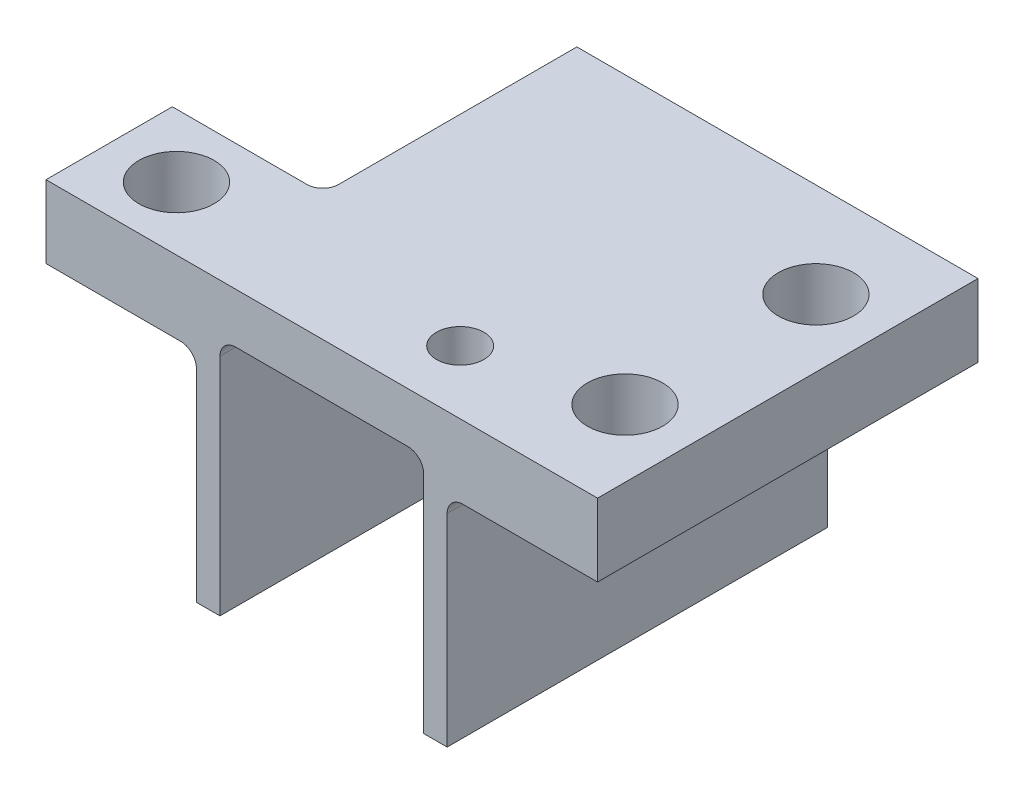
ISO-10303-21;
HEADER;
FILE_DESCRIPTION(('STEP AP214'),'2;1');
FILE_NAME('part.step','',(''),(''),'','','');
FILE_SCHEMA(('AUTOMOTIVE_DESIGN { 1 0 10303 214 1 1 1 1 }'));
ENDSEC;
DATA;
#1=APPLICATION_CONTEXT('core data for automotive mechanical design processes');
#2=APPLICATION_PROTOCOL_DEFINITION('international standard','automotive_design',2000,#1);
#3=PRODUCT_CONTEXT('',#1,'mechanical');
#4=PRODUCT('Part','Part','',(#3));
#5=PRODUCT_RELATED_PRODUCT_CATEGORY('part','',(#4));
#6=PRODUCT_DEFINITION_FORMATION('','',#4);
#7=PRODUCT_DEFINITION_CONTEXT('part definition',#1,'design');
#8=PRODUCT_DEFINITION('design','',#6,#7);
#9=PRODUCT_DEFINITION_SHAPE('','',#8);
#10=(LENGTH_UNIT() NAMED_UNIT(*) SI_UNIT(.MILLI.,.METRE.));
#11=(NAMED_UNIT(*) PLANE_ANGLE_UNIT() SI_UNIT($,.RADIAN.));
#12=(NAMED_UNIT(*) SI_UNIT($,.STERADIAN.) SOLID_ANGLE_UNIT());
#13=UNCERTAINTY_MEASURE_WITH_UNIT(LENGTH_MEASURE(1.E-05),#10,'distance_accuracy_value','');
#14=(GEOMETRIC_REPRESENTATION_CONTEXT(3) GLOBAL_UNCERTAINTY_ASSIGNED_CONTEXT((#13)) GLOBAL_UNIT_ASSIGNED_CONTEXT((#10,
#11,#12)) REPRESENTATION_CONTEXT('',''));
#15=CARTESIAN_POINT('',(0.,0.,0.));
#16=DIRECTION('',(0.,0.,1.));
#17=DIRECTION('',(1.,0.,0.));
#18=AXIS2_PLACEMENT_3D('',#15,#16,#17);
#19=CARTESIAN_POINT('',(-3.96874999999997,-7.62000000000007,6.02225000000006));
#20=DIRECTION('',(1.,0.,0.));
#21=DIRECTION('',(0.,1.00000000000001,0.));
#22=AXIS2_PLACEMENT_3D('',#19,#20,#21);
#23=PLANE('',#22);
#24=DIRECTION('',(0.,-1.00000000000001,0.));
#25=VECTOR('',#24,1.);
#26=CARTESIAN_POINT('',(-3.96874999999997,-7.62000000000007,6.02225000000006));
#27=LINE('',#26,#25);
#28=CARTESIAN_POINT('',(-3.96874999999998,-1.21249999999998,6.02225000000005));
#29=VERTEX_POINT('',#28);
#30=CARTESIAN_POINT('',(-3.96874999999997,-7.62000000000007,6.02225000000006));
#31=VERTEX_POINT('',#30);
#32=EDGE_CURVE('E381',#29,#31,#27,.T.);
#33=ORIENTED_EDGE('',*,*,#32,.F.);
#34=DIRECTION('',(0.,0.,-1.00000000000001));
#35=VECTOR('',#34,1.);
#36=CARTESIAN_POINT('',(-3.96874999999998,-1.21249999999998,6.02225000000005));
#37=LINE('',#36,#35);
#38=CARTESIAN_POINT('',(-3.96874999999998,-1.21250000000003,1.52225000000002));
#39=VERTEX_POINT('',#38);
#40=EDGE_CURVE('E403',#29,#39,#37,.T.);
#41=ORIENTED_EDGE('',*,*,#40,.T.);
#42=DIRECTION('',(0.,-1.00000000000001,0.));
#43=VECTOR('',#42,1.);
#44=CARTESIAN_POINT('',(-3.96875,1.58749999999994,1.52225000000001));
#45=LINE('',#44,#43);
#46=CARTESIAN_POINT('',(-3.96875,1.58749999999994,1.52225000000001));
#47=VERTEX_POINT('',#46);
#48=EDGE_CURVE('E384',#39,#47,#45,.F.);
#49=ORIENTED_EDGE('',*,*,#48,.T.);
#50=DIRECTION('',(0.,0.,-1.00000000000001));
#51=VECTOR('',#50,1.);
#52=CARTESIAN_POINT('',(-3.96875,1.58749999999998,6.02225000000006));
#53=LINE('',#52,#51);
#54=CARTESIAN_POINT('',(-3.96875,1.58749999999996,-6.02225000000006));
#55=VERTEX_POINT('',#54);
#56=EDGE_CURVE('E375',#47,#55,#53,.T.);
#57=ORIENTED_EDGE('',*,*,#56,.T.);
#58=DIRECTION('',(0.,-1.00000000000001,0.));
#59=VECTOR('',#58,1.);
#60=CARTESIAN_POINT('',(-3.96874999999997,-7.62000000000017,-6.02225000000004));
#61=LINE('',#60,#59);
#62=CARTESIAN_POINT('',(-3.96874999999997,-7.62000000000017,-6.02225000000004));
#63=VERTEX_POINT('',#62);
#64=EDGE_CURVE('E367',#55,#63,#61,.T.);
#65=ORIENTED_EDGE('',*,*,#64,.T.);
#66=DIRECTION('',(0.,0.,-1.00000000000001));
#67=VECTOR('',#66,1.);
#68=CARTESIAN_POINT('',(-3.96874999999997,-7.62000000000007,6.02225000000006));
#69=LINE('',#68,#67);
#70=EDGE_CURVE('E372',#31,#63,#69,.T.);
#71=ORIENTED_EDGE('',*,*,#70,.F.);
#72=EDGE_LOOP('',(#33,#41,#49,#57,#65,#71));
#73=FACE_BOUND('',#72,.T.);
#74=ADVANCED_FACE('F30',(#73),#23,.F.);
#75=CARTESIAN_POINT('',(3.96875,1.58749999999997,6.02225000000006));
#76=DIRECTION('',(0.,-1.00000000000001,0.));
#77=DIRECTION('',(1.,0.,0.));
#78=AXIS2_PLACEMENT_3D('',#75,#76,#77);
#79=PLANE('',#78);
#80=CARTESIAN_POINT('',(2.38125,1.58749999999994,4.02225000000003));
#81=DIRECTION('',(0.,-1.00000000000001,0.));
#82=DIRECTION('',(1.,0.,0.));
#83=AXIS2_PLACEMENT_3D('',#80,#81,#82);
#84=CIRCLE('',#83,0.75);
#85=CARTESIAN_POINT('',(3.13125,1.58749999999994,4.02225000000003));
#86=VERTEX_POINT('',#85);
#87=EDGE_CURVE('E195',#86,#86,#84,.T.);
#88=ORIENTED_EDGE('',*,*,#87,.T.);
#89=EDGE_LOOP('',(#88));
#90=FACE_BOUND('',#89,.T.);
#91=DIRECTION('',(-1.,0.,0.));
#92=VECTOR('',#91,1.);
#93=CARTESIAN_POINT('',(3.96875,1.58749999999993,-6.02225000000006));
#94=LINE('',#93,#92);
#95=CARTESIAN_POINT('',(8.73125,1.58749999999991,-6.02225000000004));
#96=VERTEX_POINT('',#95);
#97=EDGE_CURVE('E394',#96,#55,#94,.T.);
#98=ORIENTED_EDGE('',*,*,#97,.T.);
#99=ORIENTED_EDGE('',*,*,#56,.F.);
#100=CARTESIAN_POINT('',(-4.46875,1.58749999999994,1.52225000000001));
#101=DIRECTION('',(0.,-1.00000000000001,0.));
#102=DIRECTION('',(1.,0.,0.));
#103=AXIS2_PLACEMENT_3D('',#100,#101,#102);
#104=CIRCLE('',#103,0.5);
#105=CARTESIAN_POINT('',(-4.46875,1.58749999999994,2.02225000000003));
#106=VERTEX_POINT('',#105);
#107=EDGE_CURVE('E11',#47,#106,#104,.T.);
#108=ORIENTED_EDGE('',*,*,#107,.T.);
#109=DIRECTION('',(1.,0.,0.));
#110=VECTOR('',#109,1.);
#111=CARTESIAN_POINT('',(-3.96875,1.58749999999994,2.02225000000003));
#112=LINE('',#111,#110);
#113=CARTESIAN_POINT('',(-8.73125,1.58749999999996,2.02225));
#114=VERTEX_POINT('',#113);
#115=EDGE_CURVE('E156',#114,#106,#112,.T.);
#116=ORIENTED_EDGE('',*,*,#115,.F.);
#117=DIRECTION('',(0.,0.,-1.00000000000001));
#118=VECTOR('',#117,1.);
#119=CARTESIAN_POINT('',(-8.73125,1.58749999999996,2.02225));
#120=LINE('',#119,#118);
#121=CARTESIAN_POINT('',(-8.73125,1.58749999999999,6.02225000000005));
#122=VERTEX_POINT('',#121);
#123=EDGE_CURVE('E162',#122,#114,#120,.T.);
#124=ORIENTED_EDGE('',*,*,#123,.F.);
#125=DIRECTION('',(-1.,0.,0.));
#126=VECTOR('',#125,1.);
#127=CARTESIAN_POINT('',(3.96875,1.58749999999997,6.02225000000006));
#128=LINE('',#127,#126);
#129=CARTESIAN_POINT('',(8.73125,1.58749999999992,6.02225000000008));
#130=VERTEX_POINT('',#129);
#131=EDGE_CURVE('E221',#130,#122,#128,.T.);
#132=ORIENTED_EDGE('',*,*,#131,.F.);
#133=DIRECTION('',(0.,0.,1.00000000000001));
#134=VECTOR('',#133,1.);
#135=CARTESIAN_POINT('',(8.73125,1.58749999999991,-6.02225000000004));
#136=LINE('',#135,#134);
#137=EDGE_CURVE('E205',#96,#130,#136,.T.);
#138=ORIENTED_EDGE('',*,*,#137,.F.);
#139=EDGE_LOOP('',(#98,#99,#108,#116,#124,#132,#138));
#140=FACE_BOUND('',#139,.T.);
#141=CARTESIAN_POINT('',(6.6,1.5874999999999,-3.02225000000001));
#142=DIRECTION('',(0.,-1.00000000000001,0.));
#143=DIRECTION('',(0.,0.,-1.00000000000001));
#144=AXIS2_PLACEMENT_3D('',#141,#142,#143);
#145=CIRCLE('',#144,1.190625);
#146=CARTESIAN_POINT('',(6.6,1.5874999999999,-4.21287500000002));
#147=VERTEX_POINT('',#146);
#148=EDGE_CURVE('E192',#147,#147,#145,.T.);
#149=ORIENTED_EDGE('',*,*,#148,.T.);
#150=EDGE_LOOP('',(#149));
#151=FACE_BOUND('',#150,.T.);
#152=CARTESIAN_POINT('',(6.6,1.58749999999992,3.02225000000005));
#153=DIRECTION('',(0.,1.00000000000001,0.));
#154=DIRECTION('',(0.,0.,1.00000000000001));
#155=AXIS2_PLACEMENT_3D('',#152,#153,#154);
#156=CIRCLE('',#155,1.190625);
#157=CARTESIAN_POINT('',(6.6,1.58749999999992,4.21287500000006));
#158=VERTEX_POINT('',#157);
#159=EDGE_CURVE('E186',#158,#158,#156,.T.);
#160=ORIENTED_EDGE('',*,*,#159,.F.);
#161=EDGE_LOOP('',(#160));
#162=FACE_BOUND('',#161,.T.);
#163=CARTESIAN_POINT('',(-6.6,1.5875,4.02225000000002));
#164=DIRECTION('',(0.,-1.00000000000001,0.));
#165=DIRECTION('',(1.,0.,0.));
#166=AXIS2_PLACEMENT_3D('',#163,#164,#165);
#167=CIRCLE('',#166,1.190625);
#168=CARTESIAN_POINT('',(-5.409375,1.5875,4.02225000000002));
#169=VERTEX_POINT('',#168);
#170=EDGE_CURVE('E181',#169,#169,#167,.T.);
#171=ORIENTED_EDGE('',*,*,#170,.T.);
#172=EDGE_LOOP('',(#171));
#173=FACE_BOUND('',#172,.T.);
#174=ADVANCED_FACE('F159',(#90,#140,#151,#162,#173),#79,.F.);
#175=CARTESIAN_POINT('',(8.73125,-0.712500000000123,-6.02225000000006));
#176=DIRECTION('',(0.,1.00000000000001,0.));
#177=DIRECTION('',(0.,0.,1.00000000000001));
#178=AXIS2_PLACEMENT_3D('',#175,#176,#177);
#179=PLANE('',#178);
#180=DIRECTION('',(-1.,0.,0.));
#181=VECTOR('',#180,1.);
#182=CARTESIAN_POINT('',(8.73125,-0.712500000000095,6.02225000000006));
#183=LINE('',#182,#181);
#184=CARTESIAN_POINT('',(8.73125,-0.712500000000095,6.02225000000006));
#185=VERTEX_POINT('',#184);
#186=CARTESIAN_POINT('',(4.46875000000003,-0.712500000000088,6.02225000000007));
#187=VERTEX_POINT('',#186);
#188=EDGE_CURVE('E232',#185,#187,#183,.T.);
#189=ORIENTED_EDGE('',*,*,#188,.T.);
#190=DIRECTION('',(0.,0.,-1.00000000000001));
#191=VECTOR('',#190,1.);
#192=CARTESIAN_POINT('',(4.46875000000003,-0.712500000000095,-6.02225000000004));
#193=LINE('',#192,#191);
#194=CARTESIAN_POINT('',(4.46875000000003,-0.712500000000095,-6.02225000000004));
#195=VERTEX_POINT('',#194);
#196=EDGE_CURVE('E247',#187,#195,#193,.T.);
#197=ORIENTED_EDGE('',*,*,#196,.T.);
#198=DIRECTION('',(-1.,0.,0.));
#199=VECTOR('',#198,1.);
#200=CARTESIAN_POINT('',(8.73125,-0.712500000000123,-6.02225000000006));
#201=LINE('',#200,#199);
#202=CARTESIAN_POINT('',(8.73125,-0.712500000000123,-6.02225000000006));
#203=VERTEX_POINT('',#202);
#204=EDGE_CURVE('E212',#203,#195,#201,.T.);
#205=ORIENTED_EDGE('',*,*,#204,.F.);
#206=DIRECTION('',(0.,0.,-1.00000000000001));
#207=VECTOR('',#206,1.);
#208=CARTESIAN_POINT('',(8.73125,-0.712500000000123,-6.02225000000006));
#209=LINE('',#208,#207);
#210=EDGE_CURVE('E210',#185,#203,#209,.T.);
#211=ORIENTED_EDGE('',*,*,#210,.F.);
#212=EDGE_LOOP('',(#189,#197,#205,#211));
#213=FACE_BOUND('',#212,.T.);
#214=CARTESIAN_POINT('',(6.60000000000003,-0.712500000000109,-3.02225));
#215=DIRECTION('',(0.,-1.00000000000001,0.));
#216=DIRECTION('',(0.,0.,-1.00000000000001));
#217=AXIS2_PLACEMENT_3D('',#214,#215,#216);
#218=CIRCLE('',#217,1.190625);
#219=CARTESIAN_POINT('',(6.60000000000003,-0.712500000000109,-4.21287500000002));
#220=VERTEX_POINT('',#219);
#221=EDGE_CURVE('E189',#220,#220,#218,.T.);
#222=ORIENTED_EDGE('',*,*,#221,.F.);
#223=EDGE_LOOP('',(#222));
#224=FACE_BOUND('',#223,.T.);
#225=CARTESIAN_POINT('',(6.60000000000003,-0.712500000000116,3.02225000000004));
#226=DIRECTION('',(0.,1.00000000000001,0.));
#227=DIRECTION('',(0.,0.,1.00000000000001));
#228=AXIS2_PLACEMENT_3D('',#225,#226,#227);
#229=CIRCLE('',#228,1.190625);
#230=CARTESIAN_POINT('',(6.60000000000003,-0.712500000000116,4.21287500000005));
#231=VERTEX_POINT('',#230);
#232=EDGE_CURVE('E184',#231,#231,#229,.T.);
#233=ORIENTED_EDGE('',*,*,#232,.T.);
#234=EDGE_LOOP('',(#233));
#235=FACE_BOUND('',#234,.T.);
#236=ADVANCED_FACE('F268',(#213,#224,#235),#179,.F.);
#237=CARTESIAN_POINT('',(-3.225,0.,6.02225000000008));
#238=DIRECTION('',(0.,1.00000000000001,0.));
#239=DIRECTION('',(-1.,0.,0.));
#240=AXIS2_PLACEMENT_3D('',#237,#238,#239);
#241=PLANE('',#240);
#242=CARTESIAN_POINT('',(2.38125,0.,4.02225000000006));
#243=DIRECTION('',(0.,1.00000000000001,0.));
#244=DIRECTION('',(-1.,0.,0.));
#245=AXIS2_PLACEMENT_3D('',#242,#243,#244);
#246=CIRCLE('',#245,0.75);
#247=CARTESIAN_POINT('',(2.725,0.,4.68883528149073));
#248=VERTEX_POINT('',#247);
#249=CARTESIAN_POINT('',(2.725,0.,3.35566471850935));
#250=VERTEX_POINT('',#249);
#251=EDGE_CURVE('E200',#248,#250,#246,.F.);
#252=ORIENTED_EDGE('',*,*,#251,.F.);
#253=DIRECTION('',(0.,0.,-1.00000000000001));
#254=VECTOR('',#253,1.);
#255=CARTESIAN_POINT('',(2.725,0.,6.02225000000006));
#256=LINE('',#255,#254);
#257=CARTESIAN_POINT('',(2.725,0.,6.02225000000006));
#258=VERTEX_POINT('',#257);
#259=EDGE_CURVE('E329',#248,#258,#256,.F.);
#260=ORIENTED_EDGE('',*,*,#259,.T.);
#261=DIRECTION('',(1.,0.,0.));
#262=VECTOR('',#261,1.);
#263=CARTESIAN_POINT('',(-3.225,0.,6.02225000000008));
#264=LINE('',#263,#262);
#265=CARTESIAN_POINT('',(-2.725,0.,6.02225000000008));
#266=VERTEX_POINT('',#265);
#267=EDGE_CURVE('E347',#266,#258,#264,.T.);
#268=ORIENTED_EDGE('',*,*,#267,.F.);
#269=DIRECTION('',(0.,0.,-1.00000000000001));
#270=VECTOR('',#269,1.);
#271=CARTESIAN_POINT('',(-2.725,0.,-6.02225000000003));
#272=LINE('',#271,#270);
#273=CARTESIAN_POINT('',(-2.725,0.,-6.02225000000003));
#274=VERTEX_POINT('',#273);
#275=EDGE_CURVE('E326',#266,#274,#272,.T.);
#276=ORIENTED_EDGE('',*,*,#275,.T.);
#277=DIRECTION('',(1.,0.,0.));
#278=VECTOR('',#277,1.);
#279=CARTESIAN_POINT('',(-3.225,0.,-6.02225000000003));
#280=LINE('',#279,#278);
#281=CARTESIAN_POINT('',(2.725,-1.11022302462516E-13,-6.02225000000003));
#282=VERTEX_POINT('',#281);
#283=EDGE_CURVE('E216',#274,#282,#280,.T.);
#284=ORIENTED_EDGE('',*,*,#283,.T.);
#285=EDGE_CURVE('E335',#282,#250,#256,.F.);
#286=ORIENTED_EDGE('',*,*,#285,.T.);
#287=EDGE_LOOP('',(#252,#260,#268,#276,#284,#286));
#288=FACE_BOUND('',#287,.T.);
#289=ADVANCED_FACE('F271',(#288),#241,.F.);
#290=CARTESIAN_POINT('',(2.725,-0.500000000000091,6.02225000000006));
#291=DIRECTION('',(0.,0.,1.00000000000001));
#292=DIRECTION('',(1.,0.,0.));
#293=AXIS2_PLACEMENT_3D('',#290,#291,#292);
#294=CYLINDRICAL_SURFACE('',#293,0.5);
#295=CARTESIAN_POINT('',(2.725,0.,3.35566471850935));
#296=CARTESIAN_POINT('',(2.75430809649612,-1.20222741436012E-06,3.37074271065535));
#297=CARTESIAN_POINT('',(2.78242161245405,-0.00256863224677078,3.38771706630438));
#298=CARTESIAN_POINT('',(2.83550013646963,-0.0116309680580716,3.42460839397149));
#299=CARTESIAN_POINT('',(2.86049768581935,-0.0180802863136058,3.44448921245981));
#300=CARTESIAN_POINT('',(2.91379985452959,-0.0359389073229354,3.49260532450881));
#301=CARTESIAN_POINT('',(2.94108441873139,-0.0482296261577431,3.52162477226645));
#302=CARTESIAN_POINT('',(2.99045010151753,-0.0753432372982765,3.58300376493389));
#303=CARTESIAN_POINT('',(3.0124967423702,-0.0901818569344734,3.61538352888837));
#304=CARTESIAN_POINT('',(3.0518041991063,-0.120746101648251,3.68392133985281));
#305=CARTESIAN_POINT('',(3.06891261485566,-0.136484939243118,3.7201601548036));
#306=CARTESIAN_POINT('',(3.09732772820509,-0.165661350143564,3.795649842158));
#307=CARTESIAN_POINT('',(3.10865922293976,-0.179108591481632,3.83488699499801));
#308=CARTESIAN_POINT('',(3.12183197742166,-0.195708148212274,3.90098643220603));
#309=CARTESIAN_POINT('',(3.12564048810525,-0.200830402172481,3.92693791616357));
#310=CARTESIAN_POINT('',(3.13049350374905,-0.207436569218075,3.97951310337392));
#311=CARTESIAN_POINT('',(3.13154676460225,-0.208932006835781,4.00613440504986));
#312=CARTESIAN_POINT('',(3.13080729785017,-0.207903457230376,4.05928912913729));
#313=CARTESIAN_POINT('',(3.12901059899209,-0.205373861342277,4.08582237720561));
#314=CARTESIAN_POINT('',(3.12272430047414,-0.196946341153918,4.13806390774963));
#315=CARTESIAN_POINT('',(3.11822541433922,-0.191036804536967,4.16376902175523));
#316=CARTESIAN_POINT('',(3.10358343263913,-0.173090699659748,4.22804748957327));
#317=CARTESIAN_POINT('',(3.09169034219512,-0.159476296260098,4.26576360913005));
#318=CARTESIAN_POINT('',(3.06249653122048,-0.130509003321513,4.33838599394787));
#319=CARTESIAN_POINT('',(3.04517690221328,-0.115150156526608,4.37328188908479));
#320=CARTESIAN_POINT('',(3.0039616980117,-0.0842028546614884,4.44229959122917));
#321=CARTESIAN_POINT('',(2.97972653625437,-0.0686586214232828,4.47624103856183));
#322=CARTESIAN_POINT('',(2.92527396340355,-0.0408501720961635,4.54021202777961));
#323=CARTESIAN_POINT('',(2.89509634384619,-0.0285653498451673,4.57026549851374));
#324=CARTESIAN_POINT('',(2.84135312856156,-0.0132522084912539,4.61514873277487));
#325=CARTESIAN_POINT('',(2.81953630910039,-0.00848030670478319,4.63146815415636));
#326=CARTESIAN_POINT('',(2.77376613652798,-0.00184071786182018,4.66193836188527));
#327=CARTESIAN_POINT('',(2.74979596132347,1.53573373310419E-06,4.67606920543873));
#328=CARTESIAN_POINT('',(2.725,0.,4.68883528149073));
#329=B_SPLINE_CURVE_WITH_KNOTS('',3,(#295,#296,#297,#298,#299,#300,#301,#302,#303,#304,#305,
#306,#307,#308,#309,#310,#311,#312,#313,#314,#315,#316,#317,#318,#319,#320,#321,#322,#323,#324,
#325,#326,#327,#328),.UNSPECIFIED.,.F.,.F.,(4,2,2,2,2,2,2,2,2,2,2,2,2,2,2,2,4),(0.,
0.0984220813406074,0.195710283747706,0.320113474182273,0.445314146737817,0.574043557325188,
0.702215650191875,0.782071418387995,0.861673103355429,0.941385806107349,1.02137403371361,
1.14616734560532,1.27140042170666,1.40435430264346,1.53644645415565,1.61913160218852,
1.70253072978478),.UNSPECIFIED.);
#330=EDGE_CURVE('E240',#250,#248,#329,.T.);
#331=ORIENTED_EDGE('',*,*,#330,.F.);
#332=ORIENTED_EDGE('',*,*,#285,.F.);
#333=CARTESIAN_POINT('',(2.725,-0.500000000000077,-6.02225000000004));
#334=DIRECTION('',(0.,0.,1.00000000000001));
#335=DIRECTION('',(1.,0.,0.));
#336=AXIS2_PLACEMENT_3D('',#333,#334,#335);
#337=CIRCLE('',#336,0.5);
#338=CARTESIAN_POINT('',(3.225,-0.500000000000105,-6.02225000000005));
#339=VERTEX_POINT('',#338);
#340=EDGE_CURVE('E325',#339,#282,#337,.T.);
#341=ORIENTED_EDGE('',*,*,#340,.F.);
#342=DIRECTION('',(0.,0.,-1.00000000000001));
#343=VECTOR('',#342,1.);
#344=CARTESIAN_POINT('',(3.225,-0.500000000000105,-6.02225000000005));
#345=LINE('',#344,#343);
#346=CARTESIAN_POINT('',(3.225,-0.500000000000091,6.02225000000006));
#347=VERTEX_POINT('',#346);
#348=EDGE_CURVE('E314',#347,#339,#345,.T.);
#349=ORIENTED_EDGE('',*,*,#348,.F.);
#350=CARTESIAN_POINT('',(2.725,-0.500000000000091,6.02225000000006));
#351=DIRECTION('',(0.,0.,1.00000000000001));
#352=DIRECTION('',(1.,0.,0.));
#353=AXIS2_PLACEMENT_3D('',#350,#351,#352);
#354=CIRCLE('',#353,0.5);
#355=EDGE_CURVE('E323',#258,#347,#354,.F.);
#356=ORIENTED_EDGE('',*,*,#355,.F.);
#357=ORIENTED_EDGE('',*,*,#259,.F.);
#358=EDGE_LOOP('',(#331,#332,#341,#349,#356,#357));
#359=FACE_BOUND('',#358,.T.);
#360=ADVANCED_FACE('F250',(#359),#294,.F.);
#361=CARTESIAN_POINT('',(3.96875000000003,-7.62000000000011,6.02225000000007));
#362=DIRECTION('',(-1.,0.,0.));
#363=DIRECTION('',(0.,-1.00000000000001,0.));
#364=AXIS2_PLACEMENT_3D('',#361,#362,#363);
#365=PLANE('',#364);
#366=DIRECTION('',(0.,1.00000000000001,0.));
#367=VECTOR('',#366,1.);
#368=CARTESIAN_POINT('',(3.96875000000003,-7.62000000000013,-6.02225000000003));
#369=LINE('',#368,#367);
#370=CARTESIAN_POINT('',(3.96875000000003,-7.62000000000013,-6.02225000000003));
#371=VERTEX_POINT('',#370);
#372=CARTESIAN_POINT('',(3.96875000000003,-1.2125000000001,-6.02225000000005));
#373=VERTEX_POINT('',#372);
#374=EDGE_CURVE('E227',#371,#373,#369,.T.);
#375=ORIENTED_EDGE('',*,*,#374,.T.);
#376=DIRECTION('',(0.,0.,-1.00000000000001));
#377=VECTOR('',#376,1.);
#378=CARTESIAN_POINT('',(3.96875000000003,-1.21250000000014,6.02225000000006));
#379=LINE('',#378,#377);
#380=CARTESIAN_POINT('',(3.96875000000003,-1.21250000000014,6.02225000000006));
#381=VERTEX_POINT('',#380);
#382=EDGE_CURVE('E418',#373,#381,#379,.F.);
#383=ORIENTED_EDGE('',*,*,#382,.T.);
#384=DIRECTION('',(0.,1.00000000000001,0.));
#385=VECTOR('',#384,1.);
#386=CARTESIAN_POINT('',(3.96875000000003,-7.62000000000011,6.02225000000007));
#387=LINE('',#386,#385);
#388=CARTESIAN_POINT('',(3.96875000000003,-7.62000000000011,6.02225000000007));
#389=VERTEX_POINT('',#388);
#390=EDGE_CURVE('E218',#389,#381,#387,.T.);
#391=ORIENTED_EDGE('',*,*,#390,.F.);
#392=DIRECTION('',(0.,0.,-1.00000000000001));
#393=VECTOR('',#392,1.);
#394=CARTESIAN_POINT('',(3.96875000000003,-7.62000000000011,6.02225000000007));
#395=LINE('',#394,#393);
#396=EDGE_CURVE('E331',#389,#371,#395,.T.);
#397=ORIENTED_EDGE('',*,*,#396,.T.);
#398=EDGE_LOOP('',(#375,#383,#391,#397));
#399=FACE_BOUND('',#398,.T.);
#400=ADVANCED_FACE('F299',(#399),#365,.F.);
#401=CARTESIAN_POINT('',(3.225,0.,6.02225000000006));
#402=DIRECTION('',(1.,0.,0.));
#403=DIRECTION('',(0.,1.00000000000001,0.));
#404=AXIS2_PLACEMENT_3D('',#401,#402,#403);
#405=PLANE('',#404);
#406=DIRECTION('',(0.,-1.00000000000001,0.));
#407=VECTOR('',#406,1.);
#408=CARTESIAN_POINT('',(3.225,0.,6.02225000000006));
#409=LINE('',#408,#407);
#410=CARTESIAN_POINT('',(3.225,-7.62000000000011,6.02225000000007));
#411=VERTEX_POINT('',#410);
#412=EDGE_CURVE('E213',#347,#411,#409,.T.);
#413=ORIENTED_EDGE('',*,*,#412,.F.);
#414=ORIENTED_EDGE('',*,*,#348,.T.);
#415=DIRECTION('',(0.,-1.00000000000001,0.));
#416=VECTOR('',#415,1.);
#417=CARTESIAN_POINT('',(3.225,-1.11022302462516E-13,-6.02225000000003));
#418=LINE('',#417,#416);
#419=CARTESIAN_POINT('',(3.225,-7.62000000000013,-6.02225000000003));
#420=VERTEX_POINT('',#419);
#421=EDGE_CURVE('E237',#339,#420,#418,.T.);
#422=ORIENTED_EDGE('',*,*,#421,.T.);
#423=DIRECTION('',(0.,0.,-1.00000000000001));
#424=VECTOR('',#423,1.);
#425=CARTESIAN_POINT('',(3.225,-7.62000000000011,6.02225000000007));
#426=LINE('',#425,#424);
#427=EDGE_CURVE('E317',#411,#420,#426,.T.);
#428=ORIENTED_EDGE('',*,*,#427,.F.);
#429=EDGE_LOOP('',(#413,#414,#422,#428));
#430=FACE_BOUND('',#429,.T.);
#431=ADVANCED_FACE('F302',(#430),#405,.F.);
#432=CARTESIAN_POINT('',(3.225,-7.62000000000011,6.02225000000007));
#433=DIRECTION('',(0.,1.00000000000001,0.));
#434=DIRECTION('',(0.,0.,1.00000000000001));
#435=AXIS2_PLACEMENT_3D('',#432,#433,#434);
#436=PLANE('',#435);
#437=DIRECTION('',(1.,0.,0.));
#438=VECTOR('',#437,1.);
#439=CARTESIAN_POINT('',(3.225,-7.62000000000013,-6.02225000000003));
#440=LINE('',#439,#438);
#441=EDGE_CURVE('E391',#420,#371,#440,.T.);
#442=ORIENTED_EDGE('',*,*,#441,.T.);
#443=ORIENTED_EDGE('',*,*,#396,.F.);
#444=DIRECTION('',(1.,0.,0.));
#445=VECTOR('',#444,1.);
#446=CARTESIAN_POINT('',(3.225,-7.62000000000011,6.02225000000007));
#447=LINE('',#446,#445);
#448=EDGE_CURVE('E215',#411,#389,#447,.T.);
#449=ORIENTED_EDGE('',*,*,#448,.F.);
#450=ORIENTED_EDGE('',*,*,#427,.T.);
#451=EDGE_LOOP('',(#442,#443,#449,#450));
#452=FACE_BOUND('',#451,.T.);
#453=ADVANCED_FACE('F291',(#452),#436,.F.);
#454=CARTESIAN_POINT('',(-3.225,-7.62000000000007,6.02225000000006));
#455=DIRECTION('',(0.,1.00000000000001,0.));
#456=DIRECTION('',(0.,0.,1.00000000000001));
#457=AXIS2_PLACEMENT_3D('',#454,#455,#456);
#458=PLANE('',#457);
#459=DIRECTION('',(1.,0.,0.));
#460=VECTOR('',#459,1.);
#461=CARTESIAN_POINT('',(-3.225,-7.62000000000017,-6.02225000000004));
#462=LINE('',#461,#460);
#463=CARTESIAN_POINT('',(-3.225,-7.62000000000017,-6.02225000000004));
#464=VERTEX_POINT('',#463);
#465=EDGE_CURVE('E364',#63,#464,#462,.T.);
#466=ORIENTED_EDGE('',*,*,#465,.T.);
#467=DIRECTION('',(0.,0.,-1.00000000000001));
#468=VECTOR('',#467,1.);
#469=CARTESIAN_POINT('',(-3.225,-7.62000000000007,6.02225000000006));
#470=LINE('',#469,#468);
#471=CARTESIAN_POINT('',(-3.225,-7.62000000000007,6.02225000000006));
#472=VERTEX_POINT('',#471);
#473=EDGE_CURVE('E356',#472,#464,#470,.T.);
#474=ORIENTED_EDGE('',*,*,#473,.F.);
#475=DIRECTION('',(1.,0.,0.));
#476=VECTOR('',#475,1.);
#477=CARTESIAN_POINT('',(-3.225,-7.62000000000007,6.02225000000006));
#478=LINE('',#477,#476);
#479=EDGE_CURVE('E383',#31,#472,#478,.T.);
#480=ORIENTED_EDGE('',*,*,#479,.F.);
#481=ORIENTED_EDGE('',*,*,#70,.T.);
#482=EDGE_LOOP('',(#466,#474,#480,#481));
#483=FACE_BOUND('',#482,.T.);
#484=ADVANCED_FACE('F287',(#483),#458,.F.);
#485=CARTESIAN_POINT('',(-3.225,0.,6.02225000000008));
#486=DIRECTION('',(-1.,0.,0.));
#487=DIRECTION('',(0.,-1.00000000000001,0.));
#488=AXIS2_PLACEMENT_3D('',#485,#486,#487);
#489=PLANE('',#488);
#490=DIRECTION('',(0.,1.00000000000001,0.));
#491=VECTOR('',#490,1.);
#492=CARTESIAN_POINT('',(-3.225,0.,-6.02225000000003));
#493=LINE('',#492,#491);
#494=CARTESIAN_POINT('',(-3.225,-0.500000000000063,-6.02225000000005));
#495=VERTEX_POINT('',#494);
#496=EDGE_CURVE('E361',#464,#495,#493,.T.);
#497=ORIENTED_EDGE('',*,*,#496,.T.);
#498=DIRECTION('',(0.,0.,-1.00000000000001));
#499=VECTOR('',#498,1.);
#500=CARTESIAN_POINT('',(-3.225,-0.500000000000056,6.02225000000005));
#501=LINE('',#500,#499);
#502=CARTESIAN_POINT('',(-3.225,-0.500000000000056,6.02225000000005));
#503=VERTEX_POINT('',#502);
#504=EDGE_CURVE('E338',#495,#503,#501,.F.);
#505=ORIENTED_EDGE('',*,*,#504,.T.);
#506=DIRECTION('',(0.,1.00000000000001,0.));
#507=VECTOR('',#506,1.);
#508=CARTESIAN_POINT('',(-3.225,0.,6.02225000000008));
#509=LINE('',#508,#507);
#510=EDGE_CURVE('E349',#472,#503,#509,.T.);
#511=ORIENTED_EDGE('',*,*,#510,.F.);
#512=ORIENTED_EDGE('',*,*,#473,.T.);
#513=EDGE_LOOP('',(#497,#505,#511,#512));
#514=FACE_BOUND('',#513,.T.);
#515=ADVANCED_FACE('F277',(#514),#489,.F.);
#516=CARTESIAN_POINT('',(3.225,0.,6.02225000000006));
#517=DIRECTION('',(0.,0.,1.00000000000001));
#518=DIRECTION('',(1.,0.,0.));
#519=AXIS2_PLACEMENT_3D('',#516,#517,#518);
#520=PLANE('',#519);
#521=ORIENTED_EDGE('',*,*,#267,.T.);
#522=ORIENTED_EDGE('',*,*,#355,.T.);
#523=ORIENTED_EDGE('',*,*,#412,.T.);
#524=ORIENTED_EDGE('',*,*,#448,.T.);
#525=ORIENTED_EDGE('',*,*,#390,.T.);
#526=CARTESIAN_POINT('',(4.46875000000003,-1.21250000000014,6.02225000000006));
#527=DIRECTION('',(0.,0.,1.00000000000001));
#528=DIRECTION('',(1.,0.,0.));
#529=AXIS2_PLACEMENT_3D('',#526,#527,#528);
#530=CIRCLE('',#529,0.5);
#531=EDGE_CURVE('E411',#381,#187,#530,.F.);
#532=ORIENTED_EDGE('',*,*,#531,.T.);
#533=ORIENTED_EDGE('',*,*,#188,.F.);
#534=DIRECTION('',(0.,-1.00000000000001,0.));
#535=VECTOR('',#534,1.);
#536=CARTESIAN_POINT('',(8.73125,1.58749999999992,6.02225000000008));
#537=LINE('',#536,#535);
#538=EDGE_CURVE('E208',#130,#185,#537,.T.);
#539=ORIENTED_EDGE('',*,*,#538,.F.);
#540=ORIENTED_EDGE('',*,*,#131,.T.);
#541=DIRECTION('',(0.,-1.00000000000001,0.));
#542=VECTOR('',#541,1.);
#543=CARTESIAN_POINT('',(-8.73125000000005,7.80693777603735,6.02225000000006));
#544=LINE('',#543,#542);
#545=CARTESIAN_POINT('',(-8.73125,-0.712500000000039,6.02225000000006));
#546=VERTEX_POINT('',#545);
#547=EDGE_CURVE('E176',#122,#546,#544,.T.);
#548=ORIENTED_EDGE('',*,*,#547,.T.);
#549=DIRECTION('',(1.,0.,0.));
#550=VECTOR('',#549,1.);
#551=CARTESIAN_POINT('',(-3.96874999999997,-0.71250000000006,6.02225000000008));
#552=LINE('',#551,#550);
#553=CARTESIAN_POINT('',(-4.46874999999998,-0.71250000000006,6.02225000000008));
#554=VERTEX_POINT('',#553);
#555=EDGE_CURVE('E185',#546,#554,#552,.T.);
#556=ORIENTED_EDGE('',*,*,#555,.T.);
#557=CARTESIAN_POINT('',(-4.46874999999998,-1.21249999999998,6.02225000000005));
#558=DIRECTION('',(0.,0.,1.00000000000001));
#559=DIRECTION('',(1.,0.,0.));
#560=AXIS2_PLACEMENT_3D('',#557,#558,#559);
#561=CIRCLE('',#560,0.5);
#562=EDGE_CURVE('E39',#554,#29,#561,.F.);
#563=ORIENTED_EDGE('',*,*,#562,.T.);
#564=ORIENTED_EDGE('',*,*,#32,.T.);
#565=ORIENTED_EDGE('',*,*,#479,.T.);
#566=ORIENTED_EDGE('',*,*,#510,.T.);
#567=CARTESIAN_POINT('',(-2.725,-0.500000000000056,6.02225000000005));
#568=DIRECTION('',(0.,0.,1.00000000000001));
#569=DIRECTION('',(1.,0.,0.));
#570=AXIS2_PLACEMENT_3D('',#567,#568,#569);
#571=CIRCLE('',#570,0.5);
#572=EDGE_CURVE('E248',#503,#266,#571,.F.);
#573=ORIENTED_EDGE('',*,*,#572,.T.);
#574=EDGE_LOOP('',(#521,#522,#523,#524,#525,#532,#533,#539,#540,#548,#556,#563,#564,#565,#566,#573));
#575=FACE_BOUND('',#574,.T.);
#576=ADVANCED_FACE('F273',(#575),#520,.T.);
#577=CARTESIAN_POINT('',(3.225,-1.11022302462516E-13,-6.02225000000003));
#578=DIRECTION('',(0.,0.,1.00000000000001));
#579=DIRECTION('',(1.,0.,0.));
#580=AXIS2_PLACEMENT_3D('',#577,#578,#579);
#581=PLANE('',#580);
#582=ORIENTED_EDGE('',*,*,#421,.F.);
#583=ORIENTED_EDGE('',*,*,#340,.T.);
#584=ORIENTED_EDGE('',*,*,#283,.F.);
#585=CARTESIAN_POINT('',(-2.725,-0.500000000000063,-6.02225000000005));
#586=DIRECTION('',(0.,0.,1.00000000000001));
#587=DIRECTION('',(1.,0.,0.));
#588=AXIS2_PLACEMENT_3D('',#585,#586,#587);
#589=CIRCLE('',#588,0.5);
#590=EDGE_CURVE('E342',#274,#495,#589,.T.);
#591=ORIENTED_EDGE('',*,*,#590,.T.);
#592=ORIENTED_EDGE('',*,*,#496,.F.);
#593=ORIENTED_EDGE('',*,*,#465,.F.);
#594=ORIENTED_EDGE('',*,*,#64,.F.);
#595=ORIENTED_EDGE('',*,*,#97,.F.);
#596=DIRECTION('',(0.,1.00000000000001,0.));
#597=VECTOR('',#596,1.);
#598=CARTESIAN_POINT('',(8.73125,1.58749999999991,-6.02225000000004));
#599=LINE('',#598,#597);
#600=EDGE_CURVE('E202',#203,#96,#599,.T.);
#601=ORIENTED_EDGE('',*,*,#600,.F.);
#602=ORIENTED_EDGE('',*,*,#204,.T.);
#603=CARTESIAN_POINT('',(4.46875000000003,-1.2125000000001,-6.02225000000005));
#604=DIRECTION('',(0.,0.,1.00000000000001));
#605=DIRECTION('',(1.,0.,0.));
#606=AXIS2_PLACEMENT_3D('',#603,#604,#605);
#607=CIRCLE('',#606,0.5);
#608=EDGE_CURVE('E414',#195,#373,#607,.T.);
#609=ORIENTED_EDGE('',*,*,#608,.T.);
#610=ORIENTED_EDGE('',*,*,#374,.F.);
#611=ORIENTED_EDGE('',*,*,#441,.F.);
#612=EDGE_LOOP('',(#582,#583,#584,#591,#592,#593,#594,#595,#601,#602,#609,#610,#611));
#613=FACE_BOUND('',#612,.T.);
#614=ADVANCED_FACE('F276',(#613),#581,.F.);
#615=CARTESIAN_POINT('',(-2.725,-0.500000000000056,6.02225000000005));
#616=DIRECTION('',(0.,0.,1.00000000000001));
#617=DIRECTION('',(1.,0.,0.));
#618=AXIS2_PLACEMENT_3D('',#615,#616,#617);
#619=CYLINDRICAL_SURFACE('',#618,0.5);
#620=ORIENTED_EDGE('',*,*,#572,.F.);
#621=ORIENTED_EDGE('',*,*,#504,.F.);
#622=ORIENTED_EDGE('',*,*,#590,.F.);
#623=ORIENTED_EDGE('',*,*,#275,.F.);
#624=EDGE_LOOP('',(#620,#621,#622,#623));
#625=FACE_BOUND('',#624,.T.);
#626=ADVANCED_FACE('F266',(#625),#619,.F.);
#627=CARTESIAN_POINT('',(8.73125,1.58749999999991,-6.02225000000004));
#628=DIRECTION('',(-1.,0.,0.));
#629=DIRECTION('',(0.,0.,1.00000000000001));
#630=AXIS2_PLACEMENT_3D('',#627,#628,#629);
#631=PLANE('',#630);
#632=ORIENTED_EDGE('',*,*,#600,.T.);
#633=ORIENTED_EDGE('',*,*,#137,.T.);
#634=ORIENTED_EDGE('',*,*,#538,.T.);
#635=ORIENTED_EDGE('',*,*,#210,.T.);
#636=EDGE_LOOP('',(#632,#633,#634,#635));
#637=FACE_BOUND('',#636,.T.);
#638=ADVANCED_FACE('F260',(#637),#631,.F.);
#639=CARTESIAN_POINT('',(2.38125,-7.62002500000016,4.02225000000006));
#640=DIRECTION('',(0.,1.00000000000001,0.));
#641=DIRECTION('',(-1.,0.,0.));
#642=AXIS2_PLACEMENT_3D('',#639,#640,#641);
#643=CYLINDRICAL_SURFACE('',#642,0.75);
#644=ORIENTED_EDGE('',*,*,#87,.F.);
#645=EDGE_LOOP('',(#644));
#646=FACE_BOUND('',#645,.T.);
#647=ORIENTED_EDGE('',*,*,#251,.T.);
#648=ORIENTED_EDGE('',*,*,#330,.T.);
#649=EDGE_LOOP('',(#647,#648));
#650=FACE_BOUND('',#649,.T.);
#651=ADVANCED_FACE('F254',(#646,#650),#643,.F.);
#652=CARTESIAN_POINT('',(4.46875000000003,-1.2125000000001,-6.02225000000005));
#653=DIRECTION('',(0.,0.,1.00000000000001));
#654=DIRECTION('',(0.,-1.00000000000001,0.));
#655=AXIS2_PLACEMENT_3D('',#652,#653,#654);
#656=CYLINDRICAL_SURFACE('',#655,0.5);
#657=ORIENTED_EDGE('',*,*,#531,.F.);
#658=ORIENTED_EDGE('',*,*,#382,.F.);
#659=ORIENTED_EDGE('',*,*,#608,.F.);
#660=ORIENTED_EDGE('',*,*,#196,.F.);
#661=EDGE_LOOP('',(#657,#658,#659,#660));
#662=FACE_BOUND('',#661,.T.);
#663=ADVANCED_FACE('F259',(#662),#656,.F.);
#664=CARTESIAN_POINT('',(6.6,1.5874999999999,-3.02225000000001));
#665=DIRECTION('',(0.,-1.00000000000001,0.));
#666=DIRECTION('',(0.,0.,-1.00000000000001));
#667=AXIS2_PLACEMENT_3D('',#664,#665,#666);
#668=CYLINDRICAL_SURFACE('',#667,1.190625);
#669=ORIENTED_EDGE('',*,*,#148,.F.);
#670=EDGE_LOOP('',(#669));
#671=FACE_BOUND('',#670,.T.);
#672=ORIENTED_EDGE('',*,*,#221,.T.);
#673=EDGE_LOOP('',(#672));
#674=FACE_BOUND('',#673,.T.);
#675=ADVANCED_FACE('F262',(#671,#674),#668,.F.);
#676=CARTESIAN_POINT('',(6.6,1.58749999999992,3.02225000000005));
#677=DIRECTION('',(0.,-1.00000000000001,0.));
#678=DIRECTION('',(0.,0.,-1.00000000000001));
#679=AXIS2_PLACEMENT_3D('',#676,#677,#678);
#680=CYLINDRICAL_SURFACE('',#679,1.190625);
#681=ORIENTED_EDGE('',*,*,#159,.T.);
#682=EDGE_LOOP('',(#681));
#683=FACE_BOUND('',#682,.T.);
#684=ORIENTED_EDGE('',*,*,#232,.F.);
#685=EDGE_LOOP('',(#684));
#686=FACE_BOUND('',#685,.T.);
#687=ADVANCED_FACE('F443',(#683,#686),#680,.F.);
#688=CARTESIAN_POINT('',(-3.96874999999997,-0.71250000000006,6.02225000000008));
#689=DIRECTION('',(0.,-1.00000000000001,0.));
#690=DIRECTION('',(0.,0.,-1.00000000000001));
#691=AXIS2_PLACEMENT_3D('',#688,#689,#690);
#692=PLANE('',#691);
#693=DIRECTION('',(-1.,0.,0.));
#694=VECTOR('',#693,1.);
#695=CARTESIAN_POINT('',(-3.96874999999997,-0.712499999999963,2.02225));
#696=LINE('',#695,#694);
#697=CARTESIAN_POINT('',(-4.46874999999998,-0.712499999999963,2.02225));
#698=VERTEX_POINT('',#697);
#699=CARTESIAN_POINT('',(-8.73125,-0.712499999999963,2.02225));
#700=VERTEX_POINT('',#699);
#701=EDGE_CURVE('E164',#698,#700,#696,.T.);
#702=ORIENTED_EDGE('',*,*,#701,.F.);
#703=DIRECTION('',(0.,0.,-1.00000000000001));
#704=VECTOR('',#703,1.);
#705=CARTESIAN_POINT('',(-4.46874999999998,-0.71250000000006,6.02225000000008));
#706=LINE('',#705,#704);
#707=EDGE_CURVE('E409',#698,#554,#706,.F.);
#708=ORIENTED_EDGE('',*,*,#707,.T.);
#709=ORIENTED_EDGE('',*,*,#555,.F.);
#710=DIRECTION('',(0.,0.,1.00000000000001));
#711=VECTOR('',#710,1.);
#712=CARTESIAN_POINT('',(-8.73125,-0.712499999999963,2.02225));
#713=LINE('',#712,#711);
#714=EDGE_CURVE('E173',#700,#546,#713,.T.);
#715=ORIENTED_EDGE('',*,*,#714,.F.);
#716=EDGE_LOOP('',(#702,#708,#709,#715));
#717=FACE_BOUND('',#716,.T.);
#718=CARTESIAN_POINT('',(-6.59999999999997,-0.712500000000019,4.02225000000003));
#719=DIRECTION('',(0.,1.00000000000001,0.));
#720=DIRECTION('',(0.,0.,1.00000000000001));
#721=AXIS2_PLACEMENT_3D('',#718,#719,#720);
#722=CIRCLE('',#721,1.190625);
#723=CARTESIAN_POINT('',(-6.59999999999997,-0.712500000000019,5.21287500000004));
#724=VERTEX_POINT('',#723);
#725=EDGE_CURVE('E165',#724,#724,#722,.T.);
#726=ORIENTED_EDGE('',*,*,#725,.T.);
#727=EDGE_LOOP('',(#726));
#728=FACE_BOUND('',#727,.T.);
#729=ADVANCED_FACE('F429',(#717,#728),#692,.T.);
#730=CARTESIAN_POINT('',(-3.96874999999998,7.80693777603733,2.02225));
#731=DIRECTION('',(0.,0.,1.00000000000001));
#732=DIRECTION('',(0.,-1.00000000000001,0.));
#733=AXIS2_PLACEMENT_3D('',#730,#731,#732);
#734=PLANE('',#733);
#735=ORIENTED_EDGE('',*,*,#115,.T.);
#736=DIRECTION('',(0.,-1.00000000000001,0.));
#737=VECTOR('',#736,1.);
#738=CARTESIAN_POINT('',(-4.46874999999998,-0.712499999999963,2.02225));
#739=LINE('',#738,#737);
#740=EDGE_CURVE('E51',#106,#698,#739,.T.);
#741=ORIENTED_EDGE('',*,*,#740,.T.);
#742=ORIENTED_EDGE('',*,*,#701,.T.);
#743=DIRECTION('',(0.,-1.00000000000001,0.));
#744=VECTOR('',#743,1.);
#745=CARTESIAN_POINT('',(-8.73125000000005,7.80693777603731,2.02225000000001));
#746=LINE('',#745,#744);
#747=EDGE_CURVE('E168',#114,#700,#746,.T.);
#748=ORIENTED_EDGE('',*,*,#747,.F.);
#749=EDGE_LOOP('',(#735,#741,#742,#748));
#750=FACE_BOUND('',#749,.T.);
#751=ADVANCED_FACE('F169',(#750),#734,.F.);
#752=CARTESIAN_POINT('',(-8.73125000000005,7.80693777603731,2.02225000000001));
#753=DIRECTION('',(1.,0.,0.));
#754=DIRECTION('',(0.,1.00000000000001,0.));
#755=AXIS2_PLACEMENT_3D('',#752,#753,#754);
#756=PLANE('',#755);
#757=ORIENTED_EDGE('',*,*,#547,.F.);
#758=ORIENTED_EDGE('',*,*,#123,.T.);
#759=ORIENTED_EDGE('',*,*,#747,.T.);
#760=ORIENTED_EDGE('',*,*,#714,.T.);
#761=EDGE_LOOP('',(#757,#758,#759,#760));
#762=FACE_BOUND('',#761,.T.);
#763=ADVANCED_FACE('F175',(#762),#756,.F.);
#764=CARTESIAN_POINT('',(-6.59999999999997,7.80693777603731,4.02225000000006));
#765=DIRECTION('',(0.,-1.00000000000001,0.));
#766=DIRECTION('',(0.,0.,-1.00000000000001));
#767=AXIS2_PLACEMENT_3D('',#764,#765,#766);
#768=CYLINDRICAL_SURFACE('',#767,1.190625);
#769=ORIENTED_EDGE('',*,*,#170,.F.);
#770=EDGE_LOOP('',(#769));
#771=FACE_BOUND('',#770,.T.);
#772=ORIENTED_EDGE('',*,*,#725,.F.);
#773=EDGE_LOOP('',(#772));
#774=FACE_BOUND('',#773,.T.);
#775=ADVANCED_FACE('F431',(#771,#774),#768,.F.);
#776=CARTESIAN_POINT('',(-4.46874999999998,7.80693777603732,1.52225));
#777=DIRECTION('',(0.,1.00000000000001,0.));
#778=DIRECTION('',(-1.,0.,0.));
#779=AXIS2_PLACEMENT_3D('',#776,#777,#778);
#780=CYLINDRICAL_SURFACE('',#779,0.5);
#781=ORIENTED_EDGE('',*,*,#107,.F.);
#782=ORIENTED_EDGE('',*,*,#48,.F.);
#783=CARTESIAN_POINT('',(-4.46874999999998,-1.21250000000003,1.52225000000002));
#784=DIRECTION('',(0.,0.707106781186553,-0.707106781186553));
#785=DIRECTION('',(0.,0.707106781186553,0.707106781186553));
#786=AXIS2_PLACEMENT_3D('',#783,#784,#785);
#787=ELLIPSE('',#786,0.707106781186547,0.5);
#788=EDGE_CURVE('E34',#698,#39,#787,.T.);
#789=ORIENTED_EDGE('',*,*,#788,.F.);
#790=ORIENTED_EDGE('',*,*,#740,.F.);
#791=EDGE_LOOP('',(#781,#782,#789,#790));
#792=FACE_BOUND('',#791,.T.);
#793=ADVANCED_FACE('F32',(#792),#780,.F.);
#794=CARTESIAN_POINT('',(-4.46874999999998,-1.21249999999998,6.02225000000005));
#795=DIRECTION('',(0.,0.,-1.00000000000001));
#796=DIRECTION('',(0.,1.00000000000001,0.));
#797=AXIS2_PLACEMENT_3D('',#794,#795,#796);
#798=CYLINDRICAL_SURFACE('',#797,0.5);
#799=ORIENTED_EDGE('',*,*,#562,.F.);
#800=ORIENTED_EDGE('',*,*,#707,.F.);
#801=ORIENTED_EDGE('',*,*,#788,.T.);
#802=ORIENTED_EDGE('',*,*,#40,.F.);
#803=EDGE_LOOP('',(#799,#800,#801,#802));
#804=FACE_BOUND('',#803,.T.);
#805=ADVANCED_FACE('F405',(#804),#798,.F.);
#806=CLOSED_SHELL('',(#74,#174,#236,#289,#360,#400,#431,#453,#484,#515,#576,#614,#626,#638,#651,
#663,#675,#687,#729,#751,#763,#775,#793,#805));
#807=MANIFOLD_SOLID_BREP('B2',#806);
#808=ADVANCED_BREP_SHAPE_REPRESENTATION('',(#18,#807),#14);
#809=SHAPE_DEFINITION_REPRESENTATION(#9,#808);
ENDSEC;
END-ISO-10303-21;
